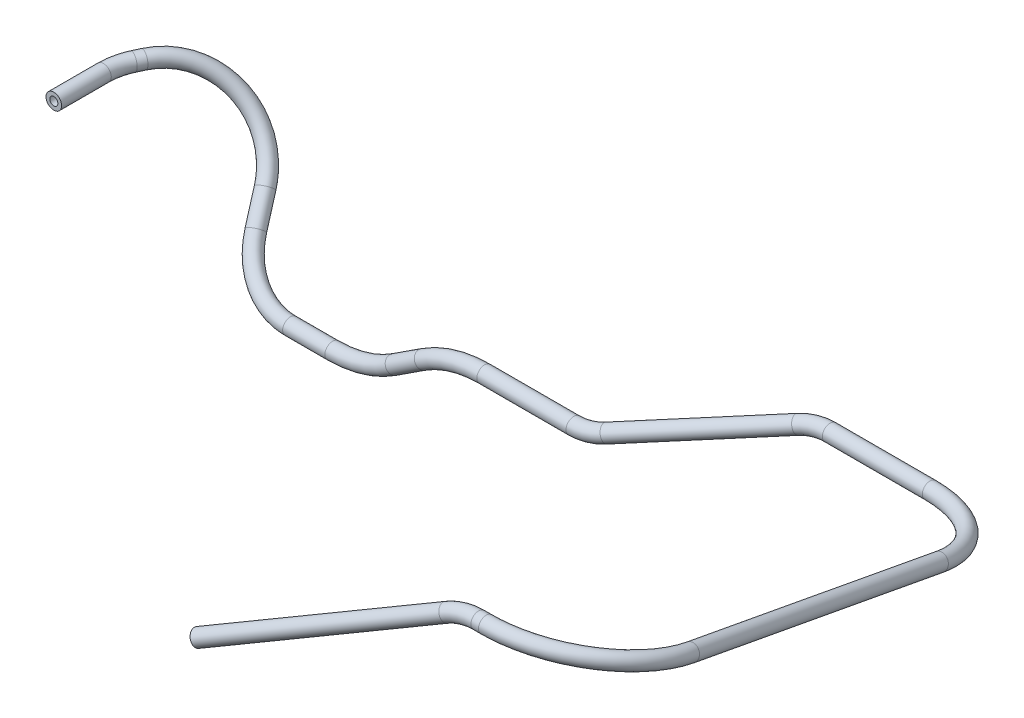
ISO-10303-21;
HEADER;
FILE_DESCRIPTION(('STEP AP214'),'2;1');
FILE_NAME('part.step','',(''),(''),'','','');
FILE_SCHEMA(('AUTOMOTIVE_DESIGN { 1 0 10303 214 1 1 1 1 }'));
ENDSEC;
DATA;
#1=APPLICATION_CONTEXT('core data for automotive mechanical design processes');
#2=APPLICATION_PROTOCOL_DEFINITION('international standard','automotive_design',2000,#1);
#3=PRODUCT_CONTEXT('',#1,'mechanical');
#4=PRODUCT('Part','Part','',(#3));
#5=PRODUCT_RELATED_PRODUCT_CATEGORY('part','',(#4));
#6=PRODUCT_DEFINITION_FORMATION('','',#4);
#7=PRODUCT_DEFINITION_CONTEXT('part definition',#1,'design');
#8=PRODUCT_DEFINITION('design','',#6,#7);
#9=PRODUCT_DEFINITION_SHAPE('','',#8);
#10=(LENGTH_UNIT() NAMED_UNIT(*) SI_UNIT(.MILLI.,.METRE.));
#11=(NAMED_UNIT(*) PLANE_ANGLE_UNIT() SI_UNIT($,.RADIAN.));
#12=(NAMED_UNIT(*) SI_UNIT($,.STERADIAN.) SOLID_ANGLE_UNIT());
#13=UNCERTAINTY_MEASURE_WITH_UNIT(LENGTH_MEASURE(1.E-05),#10,'distance_accuracy_value','');
#14=(GEOMETRIC_REPRESENTATION_CONTEXT(3) GLOBAL_UNCERTAINTY_ASSIGNED_CONTEXT((#13)) GLOBAL_UNIT_ASSIGNED_CONTEXT((#10,
#11,#12)) REPRESENTATION_CONTEXT('',''));
#15=CARTESIAN_POINT('',(0.,0.,0.));
#16=DIRECTION('',(0.,0.,1.));
#17=DIRECTION('',(1.,0.,0.));
#18=AXIS2_PLACEMENT_3D('',#15,#16,#17);
#19=CARTESIAN_POINT('',(19.688568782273,-17.0835573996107,-23.2734551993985));
#20=DIRECTION('',(0.348972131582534,-0.678855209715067,0.646044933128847));
#21=DIRECTION('',(0.,-0.68938439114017,-0.724395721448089));
#22=AXIS2_PLACEMENT_3D('',#19,#20,#21);
#23=CYLINDRICAL_SURFACE('',#22,0.825500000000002);
#24=CARTESIAN_POINT('',(19.688568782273,-17.0835573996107,-23.2734551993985));
#25=DIRECTION('',(0.348972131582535,-0.678855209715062,0.646044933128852));
#26=DIRECTION('',(0.610216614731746,-0.358598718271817,-0.706429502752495));
#27=AXIS2_PLACEMENT_3D('',#24,#25,#26);
#28=CIRCLE('',#27,0.825500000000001);
#29=CARTESIAN_POINT('',(20.192302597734,-17.379580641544,-23.8566127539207));
#30=VERTEX_POINT('',#29);
#31=EDGE_CURVE('E346',#30,#30,#28,.F.);
#32=ORIENTED_EDGE('',*,*,#31,.T.);
#33=EDGE_LOOP('',(#32));
#34=FACE_BOUND('',#33,.T.);
#35=CARTESIAN_POINT('',(21.9045418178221,-21.3942879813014,-19.1710698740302));
#36=DIRECTION('',(0.348972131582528,-0.678855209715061,0.646044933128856));
#37=DIRECTION('',(-0.937133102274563,-0.252793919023,0.240575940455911));
#38=AXIS2_PLACEMENT_3D('',#35,#36,#37);
#39=CIRCLE('',#38,0.825500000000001);
#40=CARTESIAN_POINT('',(21.1309384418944,-21.6029693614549,-18.9724744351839));
#41=VERTEX_POINT('',#40);
#42=EDGE_CURVE('E365',#41,#41,#39,.T.);
#43=ORIENTED_EDGE('',*,*,#42,.T.);
#44=EDGE_LOOP('',(#43));
#45=FACE_BOUND('',#44,.T.);
#46=ADVANCED_FACE('F15',(#34,#45),#23,.F.);
#47=CARTESIAN_POINT('',(35.4164393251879,-17.7494209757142,-22.6397739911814));
#48=DIRECTION('',(0.,0.689384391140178,0.724395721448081));
#49=DIRECTION('',(1.,0.,0.));
#50=AXIS2_PLACEMENT_3D('',#47,#48,#49);
#51=TOROIDAL_SURFACE('',#50,14.4183333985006,0.825500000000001);
#52=ORIENTED_EDGE('',*,*,#42,.F.);
#53=EDGE_LOOP('',(#52));
#54=FACE_BOUND('',#53,.T.);
#55=CARTESIAN_POINT('',(35.4164393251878,-28.194,-12.7));
#56=DIRECTION('',(1.,0.,0.));
#57=DIRECTION('',(0.,0.,-1.));
#58=AXIS2_PLACEMENT_3D('',#55,#56,#57);
#59=CIRCLE('',#58,0.825500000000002);
#60=CARTESIAN_POINT('',(35.4164393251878,-28.194,-13.5255));
#61=VERTEX_POINT('',#60);
#62=EDGE_CURVE('E341',#61,#61,#59,.T.);
#63=ORIENTED_EDGE('',*,*,#62,.T.);
#64=EDGE_LOOP('',(#63));
#65=FACE_BOUND('',#64,.T.);
#66=ADVANCED_FACE('F357',(#54,#65),#51,.F.);
#67=CARTESIAN_POINT('',(10.4785734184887,-11.6712292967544,-12.6113193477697));
#68=DIRECTION('',(-0.71123423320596,-0.640751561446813,-0.289107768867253));
#69=DIRECTION('',(0.702955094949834,-0.648298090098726,-0.292512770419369));
#70=AXIS2_PLACEMENT_3D('',#67,#68,#69);
#71=TOROIDAL_SURFACE('',#70,15.09299344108,0.825500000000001);
#72=CARTESIAN_POINT('',(1.67497659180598,-0.087763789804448,-16.6260996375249));
#73=DIRECTION('',(0.392324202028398,-0.0205566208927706,-0.919597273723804));
#74=DIRECTION('',(-0.919791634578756,0.,-0.392407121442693));
#75=AXIS2_PLACEMENT_3D('',#72,#73,#74);
#76=CIRCLE('',#75,0.8255);
#77=CARTESIAN_POINT('',(0.915688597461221,-0.087763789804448,-16.9500317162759));
#78=VERTEX_POINT('',#77);
#79=EDGE_CURVE('E336',#78,#78,#76,.F.);
#80=ORIENTED_EDGE('',*,*,#79,.T.);
#81=EDGE_LOOP('',(#80));
#82=FACE_BOUND('',#81,.T.);
#83=ORIENTED_EDGE('',*,*,#31,.F.);
#84=EDGE_LOOP('',(#83));
#85=FACE_BOUND('',#84,.T.);
#86=ADVANCED_FACE('F353',(#82,#85),#71,.F.);
#87=CARTESIAN_POINT('',(35.4164393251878,-28.194,-12.7));
#88=DIRECTION('',(1.,0.,0.));
#89=DIRECTION('',(0.,0.,-1.));
#90=AXIS2_PLACEMENT_3D('',#87,#88,#89);
#91=CYLINDRICAL_SURFACE('',#90,0.825500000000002);
#92=ORIENTED_EDGE('',*,*,#62,.F.);
#93=EDGE_LOOP('',(#92));
#94=FACE_BOUND('',#93,.T.);
#95=CARTESIAN_POINT('',(44.0021066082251,-28.194,-12.7));
#96=DIRECTION('',(1.,0.,0.));
#97=DIRECTION('',(0.,-1.,0.));
#98=AXIS2_PLACEMENT_3D('',#95,#96,#97);
#99=CIRCLE('',#98,0.825500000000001);
#100=CARTESIAN_POINT('',(44.0021066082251,-29.0195,-12.7));
#101=VERTEX_POINT('',#100);
#102=EDGE_CURVE('E330',#101,#101,#99,.T.);
#103=ORIENTED_EDGE('',*,*,#102,.T.);
#104=EDGE_LOOP('',(#103));
#105=FACE_BOUND('',#104,.T.);
#106=ADVANCED_FACE('F356',(#94,#105),#91,.F.);
#107=CARTESIAN_POINT('',(1.01971579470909,-0.0534300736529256,-15.0901861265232));
#108=DIRECTION('',(0.392324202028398,-0.0205566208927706,-0.919597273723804));
#109=DIRECTION('',(-0.919791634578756,0.,-0.392407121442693));
#110=AXIS2_PLACEMENT_3D('',#107,#108,#109);
#111=CYLINDRICAL_SURFACE('',#110,0.8255);
#112=CARTESIAN_POINT('',(1.01971579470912,-0.0534300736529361,-15.0901861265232));
#113=DIRECTION('',(0.392324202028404,-0.0205566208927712,-0.919597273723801));
#114=DIRECTION('',(-0.918337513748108,0.0481181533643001,-0.392862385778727));
#115=AXIS2_PLACEMENT_3D('',#112,#113,#114);
#116=CIRCLE('',#115,0.8255);
#117=CARTESIAN_POINT('',(0.261628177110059,-0.0137085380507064,-15.4144940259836));
#118=VERTEX_POINT('',#117);
#119=EDGE_CURVE('E326',#118,#118,#116,.F.);
#120=ORIENTED_EDGE('',*,*,#119,.T.);
#121=EDGE_LOOP('',(#120));
#122=FACE_BOUND('',#121,.T.);
#123=ORIENTED_EDGE('',*,*,#79,.F.);
#124=EDGE_LOOP('',(#123));
#125=FACE_BOUND('',#124,.T.);
#126=ADVANCED_FACE('F648',(#122,#125),#111,.F.);
#127=CARTESIAN_POINT('',(44.0021066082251,-5.334,-12.7));
#128=DIRECTION('',(0.,0.,1.));
#129=DIRECTION('',(1.,0.,0.));
#130=AXIS2_PLACEMENT_3D('',#127,#128,#129);
#131=TOROIDAL_SURFACE('',#130,22.86,0.825500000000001);
#132=ORIENTED_EDGE('',*,*,#102,.F.);
#133=EDGE_LOOP('',(#132));
#134=FACE_BOUND('',#133,.T.);
#135=CARTESIAN_POINT('',(56.493305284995,-24.4794839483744,-12.7));
#136=DIRECTION('',(0.83751023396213,0.546421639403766,0.));
#137=DIRECTION('',(-0.546421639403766,0.83751023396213,0.));
#138=AXIS2_PLACEMENT_3D('',#135,#136,#137);
#139=CIRCLE('',#138,0.825500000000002);
#140=CARTESIAN_POINT('',(56.0422342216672,-23.7881192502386,-12.7));
#141=VERTEX_POINT('',#140);
#142=EDGE_CURVE('E329',#141,#141,#139,.T.);
#143=ORIENTED_EDGE('',*,*,#142,.T.);
#144=EDGE_LOOP('',(#143));
#145=FACE_BOUND('',#144,.T.);
#146=ADVANCED_FACE('F317',(#134,#145),#131,.F.);
#147=CARTESIAN_POINT('',(12.6826022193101,-0.664530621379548,-10.1008338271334));
#148=DIRECTION('',(-0.0523252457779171,-0.998630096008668,0.));
#149=DIRECTION('',(0.998630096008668,-0.0523252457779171,0.));
#150=AXIS2_PLACEMENT_3D('',#147,#148,#149);
#151=TOROIDAL_SURFACE('',#150,12.7,0.8255);
#152=CARTESIAN_POINT('',(0.,0.,-10.1008338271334));
#153=DIRECTION('',(0.,0.,-1.));
#154=DIRECTION('',(-1.,0.,0.));
#155=AXIS2_PLACEMENT_3D('',#152,#153,#154);
#156=CIRCLE('',#155,0.8255);
#157=CARTESIAN_POINT('',(-0.8255,0.,-10.1008338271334));
#158=VERTEX_POINT('',#157);
#159=EDGE_CURVE('E702',#158,#158,#156,.F.);
#160=ORIENTED_EDGE('',*,*,#159,.T.);
#161=EDGE_LOOP('',(#160));
#162=FACE_BOUND('',#161,.T.);
#163=ORIENTED_EDGE('',*,*,#119,.F.);
#164=EDGE_LOOP('',(#163));
#165=FACE_BOUND('',#164,.T.);
#166=ADVANCED_FACE('F312',(#162,#165),#151,.F.);
#167=CARTESIAN_POINT('',(56.493305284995,-24.4794839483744,-12.7));
#168=DIRECTION('',(0.83751023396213,0.546421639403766,0.));
#169=DIRECTION('',(-0.546421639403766,0.83751023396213,0.));
#170=AXIS2_PLACEMENT_3D('',#167,#168,#169);
#171=CYLINDRICAL_SURFACE('',#170,0.825500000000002);
#172=ORIENTED_EDGE('',*,*,#142,.F.);
#173=EDGE_LOOP('',(#172));
#174=FACE_BOUND('',#173,.T.);
#175=CARTESIAN_POINT('',(62.4112423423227,-20.6184100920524,-12.7));
#176=DIRECTION('',(0.837510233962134,0.546421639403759,0.));
#177=DIRECTION('',(-0.546421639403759,0.837510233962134,0.));
#178=AXIS2_PLACEMENT_3D('',#175,#176,#177);
#179=CIRCLE('',#178,0.825500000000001);
#180=CARTESIAN_POINT('',(61.9601712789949,-19.9270453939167,-12.7));
#181=VERTEX_POINT('',#180);
#182=EDGE_CURVE('E296',#181,#181,#179,.T.);
#183=ORIENTED_EDGE('',*,*,#182,.T.);
#184=EDGE_LOOP('',(#183));
#185=FACE_BOUND('',#184,.T.);
#186=ADVANCED_FACE('F308',(#174,#185),#171,.F.);
#187=CARTESIAN_POINT('',(0.,0.,0.));
#188=DIRECTION('',(0.,0.,-1.));
#189=DIRECTION('',(-1.,0.,0.));
#190=AXIS2_PLACEMENT_3D('',#187,#188,#189);
#191=CYLINDRICAL_SURFACE('',#190,0.8255);
#192=CARTESIAN_POINT('',(0.,0.,0.));
#193=DIRECTION('',(0.,0.,-1.));
#194=DIRECTION('',(-1.,0.,0.));
#195=AXIS2_PLACEMENT_3D('',#192,#193,#194);
#196=CIRCLE('',#195,0.8255);
#197=CARTESIAN_POINT('',(-0.8255,0.,0.));
#198=VERTEX_POINT('',#197);
#199=EDGE_CURVE('E18',#198,#198,#196,.T.);
#200=ORIENTED_EDGE('',*,*,#199,.F.);
#201=EDGE_LOOP('',(#200));
#202=FACE_BOUND('',#201,.T.);
#203=ORIENTED_EDGE('',*,*,#159,.F.);
#204=EDGE_LOOP('',(#203));
#205=FACE_BOUND('',#204,.T.);
#206=ADVANCED_FACE('F304',(#202,#205),#191,.F.);
#207=CARTESIAN_POINT('',(74.9024410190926,-39.7638940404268,-12.7));
#208=DIRECTION('',(0.,0.,-1.));
#209=DIRECTION('',(1.,0.,0.));
#210=AXIS2_PLACEMENT_3D('',#207,#208,#209);
#211=TOROIDAL_SURFACE('',#210,22.86,0.825500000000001);
#212=ORIENTED_EDGE('',*,*,#182,.F.);
#213=EDGE_LOOP('',(#212));
#214=FACE_BOUND('',#213,.T.);
#215=CARTESIAN_POINT('',(74.9024410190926,-16.9038940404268,-12.7));
#216=DIRECTION('',(1.,0.,0.));
#217=DIRECTION('',(0.,0.,-1.));
#218=AXIS2_PLACEMENT_3D('',#215,#216,#217);
#219=CIRCLE('',#218,0.825500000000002);
#220=CARTESIAN_POINT('',(74.9024410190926,-16.9038940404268,-13.5255));
#221=VERTEX_POINT('',#220);
#222=EDGE_CURVE('E289',#221,#221,#219,.T.);
#223=ORIENTED_EDGE('',*,*,#222,.T.);
#224=EDGE_LOOP('',(#223));
#225=FACE_BOUND('',#224,.T.);
#226=ADVANCED_FACE('F299',(#214,#225),#211,.F.);
#227=CARTESIAN_POINT('',(0.,0.,0.));
#228=DIRECTION('',(0.,0.,1.));
#229=DIRECTION('',(1.,0.,0.));
#230=AXIS2_PLACEMENT_3D('',#227,#228,#229);
#231=PLANE('',#230);
#232=ORIENTED_EDGE('',*,*,#199,.T.);
#233=EDGE_LOOP('',(#232));
#234=FACE_BOUND('',#233,.T.);
#235=CARTESIAN_POINT('',(0.,0.,0.));
#236=DIRECTION('',(0.,0.,-1.));
#237=DIRECTION('',(-1.,0.,0.));
#238=AXIS2_PLACEMENT_3D('',#235,#236,#237);
#239=CIRCLE('',#238,1.5875);
#240=CARTESIAN_POINT('',(-1.5875,0.,0.));
#241=VERTEX_POINT('',#240);
#242=EDGE_CURVE('E286',#241,#241,#239,.T.);
#243=ORIENTED_EDGE('',*,*,#242,.F.);
#244=EDGE_LOOP('',(#243));
#245=FACE_BOUND('',#244,.T.);
#246=ADVANCED_FACE('F303',(#234,#245),#231,.T.);
#247=CARTESIAN_POINT('',(74.9024410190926,-16.9038940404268,-12.7));
#248=DIRECTION('',(1.,0.,0.));
#249=DIRECTION('',(0.,0.,-1.));
#250=AXIS2_PLACEMENT_3D('',#247,#248,#249);
#251=CYLINDRICAL_SURFACE('',#250,0.825500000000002);
#252=ORIENTED_EDGE('',*,*,#222,.F.);
#253=EDGE_LOOP('',(#252));
#254=FACE_BOUND('',#253,.T.);
#255=CARTESIAN_POINT('',(93.0384381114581,-16.9038940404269,-12.7));
#256=DIRECTION('',(1.,0.,0.));
#257=DIRECTION('',(0.,-0.779129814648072,0.626862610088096));
#258=AXIS2_PLACEMENT_3D('',#255,#256,#257);
#259=CIRCLE('',#258,0.825500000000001);
#260=CARTESIAN_POINT('',(93.0384381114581,-17.5470657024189,-12.1825249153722));
#261=VERTEX_POINT('',#260);
#262=EDGE_CURVE('E283',#261,#261,#259,.T.);
#263=ORIENTED_EDGE('',*,*,#262,.T.);
#264=EDGE_LOOP('',(#263));
#265=FACE_BOUND('',#264,.T.);
#266=ADVANCED_FACE('F381',(#254,#265),#251,.F.);
#267=CARTESIAN_POINT('',(0.,0.,0.));
#268=DIRECTION('',(0.,0.,-1.));
#269=DIRECTION('',(-1.,0.,0.));
#270=AXIS2_PLACEMENT_3D('',#267,#268,#269);
#271=CYLINDRICAL_SURFACE('',#270,1.5875);
#272=ORIENTED_EDGE('',*,*,#242,.T.);
#273=EDGE_LOOP('',(#272));
#274=FACE_BOUND('',#273,.T.);
#275=CARTESIAN_POINT('',(0.,0.,-10.1008338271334));
#276=DIRECTION('',(0.,0.,-1.));
#277=DIRECTION('',(-0.998630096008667,0.0523252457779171,0.));
#278=AXIS2_PLACEMENT_3D('',#275,#276,#277);
#279=CIRCLE('',#278,1.5875);
#280=CARTESIAN_POINT('',(-1.58532527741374,0.0830663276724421,-10.1008338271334));
#281=VERTEX_POINT('',#280);
#282=EDGE_CURVE('E261',#281,#281,#279,.T.);
#283=ORIENTED_EDGE('',*,*,#282,.F.);
#284=EDGE_LOOP('',(#283));
#285=FACE_BOUND('',#284,.T.);
#286=ADVANCED_FACE('F277',(#274,#285),#271,.T.);
#287=CARTESIAN_POINT('',(93.0384381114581,-7.00894539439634,-20.6611551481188));
#288=DIRECTION('',(0.,0.626862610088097,0.779129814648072));
#289=DIRECTION('',(1.,0.,0.));
#290=AXIS2_PLACEMENT_3D('',#287,#288,#289);
#291=TOROIDAL_SURFACE('',#290,12.7,0.825500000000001);
#292=ORIENTED_EDGE('',*,*,#262,.F.);
#293=EDGE_LOOP('',(#292));
#294=FACE_BOUND('',#293,.T.);
#295=CARTESIAN_POINT('',(98.7661993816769,-15.8403999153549,-13.5556529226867));
#296=DIRECTION('',(0.892521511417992,0.351391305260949,-0.282718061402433));
#297=DIRECTION('',(-0.366336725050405,0.930482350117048,0.));
#298=AXIS2_PLACEMENT_3D('',#295,#296,#297);
#299=CIRCLE('',#298,0.825500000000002);
#300=CARTESIAN_POINT('',(98.4637884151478,-15.0722867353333,-13.5556529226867));
#301=VERTEX_POINT('',#300);
#302=EDGE_CURVE('E256',#301,#301,#299,.T.);
#303=ORIENTED_EDGE('',*,*,#302,.T.);
#304=EDGE_LOOP('',(#303));
#305=FACE_BOUND('',#304,.T.);
#306=ADVANCED_FACE('F272',(#294,#305),#291,.F.);
#307=CARTESIAN_POINT('',(12.6826022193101,-0.664530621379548,-10.1008338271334));
#308=DIRECTION('',(-0.0523252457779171,-0.998630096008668,0.));
#309=DIRECTION('',(0.998630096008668,-0.0523252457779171,0.));
#310=AXIS2_PLACEMENT_3D('',#307,#308,#309);
#311=TOROIDAL_SURFACE('',#310,12.7,1.5875);
#312=ORIENTED_EDGE('',*,*,#282,.T.);
#313=EDGE_LOOP('',(#312));
#314=FACE_BOUND('',#313,.T.);
#315=CARTESIAN_POINT('',(1.01971579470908,-0.0534300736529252,-15.0901861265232));
#316=DIRECTION('',(0.392324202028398,-0.0205566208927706,-0.919597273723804));
#317=DIRECTION('',(-0.919791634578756,0.,-0.392407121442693));
#318=AXIS2_PLACEMENT_3D('',#315,#316,#317);
#319=CIRCLE('',#318,1.5875);
#320=CARTESIAN_POINT('',(-0.440453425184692,-0.0534300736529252,-15.7131324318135));
#321=VERTEX_POINT('',#320);
#322=EDGE_CURVE('E251',#321,#321,#319,.T.);
#323=ORIENTED_EDGE('',*,*,#322,.F.);
#324=EDGE_LOOP('',(#323));
#325=FACE_BOUND('',#324,.T.);
#326=ADVANCED_FACE('F268',(#314,#325),#311,.T.);
#327=CARTESIAN_POINT('',(98.7661993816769,-15.8403999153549,-13.5556529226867));
#328=DIRECTION('',(0.892521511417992,0.351391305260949,-0.282718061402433));
#329=DIRECTION('',(-0.366336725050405,0.930482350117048,0.));
#330=AXIS2_PLACEMENT_3D('',#327,#328,#329);
#331=CYLINDRICAL_SURFACE('',#330,0.825500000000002);
#332=ORIENTED_EDGE('',*,*,#302,.F.);
#333=EDGE_LOOP('',(#332));
#334=FACE_BOUND('',#333,.T.);
#335=CARTESIAN_POINT('',(128.344262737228,-4.19533124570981,-22.9248979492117));
#336=DIRECTION('',(0.892521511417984,0.351391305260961,-0.282718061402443));
#337=DIRECTION('',(-0.451004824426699,0.695390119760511,-0.55948836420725));
#338=AXIS2_PLACEMENT_3D('',#335,#336,#337);
#339=CIRCLE('',#338,0.825500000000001);
#340=CARTESIAN_POINT('',(127.971958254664,-3.62128670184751,-23.3867555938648));
#341=VERTEX_POINT('',#340);
#342=EDGE_CURVE('E248',#341,#341,#339,.T.);
#343=ORIENTED_EDGE('',*,*,#342,.T.);
#344=EDGE_LOOP('',(#343));
#345=FACE_BOUND('',#344,.T.);
#346=ADVANCED_FACE('F271',(#334,#345),#331,.F.);
#347=CARTESIAN_POINT('',(1.01971579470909,-0.0534300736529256,-15.0901861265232));
#348=DIRECTION('',(0.392324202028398,-0.0205566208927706,-0.919597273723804));
#349=DIRECTION('',(-0.919791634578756,0.,-0.392407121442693));
#350=AXIS2_PLACEMENT_3D('',#347,#348,#349);
#351=CYLINDRICAL_SURFACE('',#350,1.5875);
#352=ORIENTED_EDGE('',*,*,#322,.T.);
#353=EDGE_LOOP('',(#352));
#354=FACE_BOUND('',#353,.T.);
#355=CARTESIAN_POINT('',(1.67497659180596,-0.0877637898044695,-16.6260996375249));
#356=DIRECTION('',(0.392324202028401,-0.0205566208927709,-0.919597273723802));
#357=DIRECTION('',(-0.583290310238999,0.767473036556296,-0.266002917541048));
#358=AXIS2_PLACEMENT_3D('',#355,#356,#357);
#359=CIRCLE('',#358,1.5875);
#360=CARTESIAN_POINT('',(0.749003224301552,1.13059965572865,-17.0483792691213));
#361=VERTEX_POINT('',#360);
#362=EDGE_CURVE('E226',#361,#361,#359,.T.);
#363=ORIENTED_EDGE('',*,*,#362,.F.);
#364=EDGE_LOOP('',(#363));
#365=FACE_BOUND('',#364,.T.);
#366=ADVANCED_FACE('F242',(#354,#365),#351,.T.);
#367=CARTESIAN_POINT('',(134.072024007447,-13.0267857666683,-15.8193957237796));
#368=DIRECTION('',(0.,-0.626862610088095,-0.779129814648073));
#369=DIRECTION('',(1.,0.,0.));
#370=AXIS2_PLACEMENT_3D('',#367,#368,#369);
#371=TOROIDAL_SURFACE('',#370,12.7,0.825500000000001);
#372=ORIENTED_EDGE('',*,*,#342,.F.);
#373=EDGE_LOOP('',(#372));
#374=FACE_BOUND('',#373,.T.);
#375=CARTESIAN_POINT('',(134.072024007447,-3.13183712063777,-23.7805508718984));
#376=DIRECTION('',(1.,0.,0.));
#377=DIRECTION('',(0.,1.,0.));
#378=AXIS2_PLACEMENT_3D('',#375,#376,#377);
#379=CIRCLE('',#378,0.825500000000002);
#380=CARTESIAN_POINT('',(134.072024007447,-2.30633712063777,-23.7805508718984));
#381=VERTEX_POINT('',#380);
#382=EDGE_CURVE('E221',#381,#381,#379,.T.);
#383=ORIENTED_EDGE('',*,*,#382,.T.);
#384=EDGE_LOOP('',(#383));
#385=FACE_BOUND('',#384,.T.);
#386=ADVANCED_FACE('F237',(#374,#385),#371,.F.);
#387=CARTESIAN_POINT('',(10.4785734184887,-11.6712292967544,-12.6113193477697));
#388=DIRECTION('',(-0.71123423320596,-0.640751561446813,-0.289107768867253));
#389=DIRECTION('',(0.702955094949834,-0.648298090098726,-0.292512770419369));
#390=AXIS2_PLACEMENT_3D('',#387,#388,#389);
#391=TOROIDAL_SURFACE('',#390,15.09299344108,1.5875);
#392=ORIENTED_EDGE('',*,*,#362,.T.);
#393=EDGE_LOOP('',(#392));
#394=FACE_BOUND('',#393,.T.);
#395=CARTESIAN_POINT('',(19.688568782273,-17.0835573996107,-23.2734551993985));
#396=DIRECTION('',(0.348972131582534,-0.678855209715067,0.646044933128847));
#397=DIRECTION('',(0.,-0.68938439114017,-0.724395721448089));
#398=AXIS2_PLACEMENT_3D('',#395,#396,#397);
#399=CIRCLE('',#398,1.5875);
#400=CARTESIAN_POINT('',(19.688568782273,-18.1779551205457,-24.4234334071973));
#401=VERTEX_POINT('',#400);
#402=EDGE_CURVE('E216',#401,#401,#399,.T.);
#403=ORIENTED_EDGE('',*,*,#402,.F.);
#404=EDGE_LOOP('',(#403));
#405=FACE_BOUND('',#404,.T.);
#406=ADVANCED_FACE('F233',(#394,#405),#391,.T.);
#407=CARTESIAN_POINT('',(134.072024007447,-3.13183712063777,-23.7805508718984));
#408=DIRECTION('',(1.,0.,0.));
#409=DIRECTION('',(0.,1.,0.));
#410=AXIS2_PLACEMENT_3D('',#407,#408,#409);
#411=CYLINDRICAL_SURFACE('',#410,0.825500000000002);
#412=ORIENTED_EDGE('',*,*,#382,.F.);
#413=EDGE_LOOP('',(#412));
#414=FACE_BOUND('',#413,.T.);
#415=CARTESIAN_POINT('',(154.397864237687,-3.1318371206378,-23.7805508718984));
#416=DIRECTION('',(1.,0.,0.));
#417=DIRECTION('',(0.,-0.249318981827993,-0.968421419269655));
#418=AXIS2_PLACEMENT_3D('',#415,#416,#417);
#419=CIRCLE('',#418,0.825500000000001);
#420=CARTESIAN_POINT('',(154.397864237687,-3.33764994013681,-24.5799827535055));
#421=VERTEX_POINT('',#420);
#422=EDGE_CURVE('E213',#421,#421,#419,.T.);
#423=ORIENTED_EDGE('',*,*,#422,.T.);
#424=EDGE_LOOP('',(#423));
#425=FACE_BOUND('',#424,.T.);
#426=ADVANCED_FACE('F236',(#414,#425),#411,.F.);
#427=CARTESIAN_POINT('',(19.688568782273,-17.0835573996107,-23.2734551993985));
#428=DIRECTION('',(0.348972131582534,-0.678855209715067,0.646044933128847));
#429=DIRECTION('',(0.,-0.68938439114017,-0.724395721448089));
#430=AXIS2_PLACEMENT_3D('',#427,#428,#429);
#431=CYLINDRICAL_SURFACE('',#430,1.5875);
#432=ORIENTED_EDGE('',*,*,#402,.T.);
#433=EDGE_LOOP('',(#432));
#434=FACE_BOUND('',#433,.T.);
#435=CARTESIAN_POINT('',(21.9045418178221,-21.3942879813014,-19.1710698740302));
#436=DIRECTION('',(0.348972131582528,-0.67885520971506,0.646044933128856));
#437=DIRECTION('',(-0.937133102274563,-0.252793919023,0.240575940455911));
#438=AXIS2_PLACEMENT_3D('',#435,#436,#437);
#439=CIRCLE('',#438,1.5875);
#440=CARTESIAN_POINT('',(20.4168430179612,-21.7955983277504,-18.7891555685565));
#441=VERTEX_POINT('',#440);
#442=EDGE_CURVE('E191',#441,#441,#439,.T.);
#443=ORIENTED_EDGE('',*,*,#442,.F.);
#444=EDGE_LOOP('',(#443));
#445=FACE_BOUND('',#444,.T.);
#446=ADVANCED_FACE('F207',(#434,#445),#431,.T.);
#447=CARTESIAN_POINT('',(154.397864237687,1.30105437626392,-6.56201803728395));
#448=DIRECTION('',(0.,-0.968421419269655,0.249318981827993));
#449=DIRECTION('',(1.,0.,0.));
#450=AXIS2_PLACEMENT_3D('',#447,#448,#449);
#451=TOROIDAL_SURFACE('',#450,17.78,0.825500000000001);
#452=ORIENTED_EDGE('',*,*,#422,.F.);
#453=EDGE_LOOP('',(#452));
#454=FACE_BOUND('',#453,.T.);
#455=CARTESIAN_POINT('',(172.112887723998,0.922422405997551,-8.03272559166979));
#456=DIRECTION('',(0.0854142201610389,0.2484078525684,0.964882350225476));
#457=DIRECTION('',(0.,-0.968421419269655,0.249318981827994));
#458=AXIS2_PLACEMENT_3D('',#455,#456,#457);
#459=CIRCLE('',#458,0.825500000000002);
#460=CARTESIAN_POINT('',(172.112887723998,0.122990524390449,-7.82691277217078));
#461=VERTEX_POINT('',#460);
#462=EDGE_CURVE('E186',#461,#461,#459,.T.);
#463=ORIENTED_EDGE('',*,*,#462,.T.);
#464=EDGE_LOOP('',(#463));
#465=FACE_BOUND('',#464,.T.);
#466=ADVANCED_FACE('F202',(#454,#465),#451,.F.);
#467=CARTESIAN_POINT('',(35.4164393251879,-17.7494209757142,-22.6397739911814));
#468=DIRECTION('',(0.,0.689384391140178,0.724395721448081));
#469=DIRECTION('',(1.,0.,0.));
#470=AXIS2_PLACEMENT_3D('',#467,#468,#469);
#471=TOROIDAL_SURFACE('',#470,14.4183333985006,1.5875);
#472=ORIENTED_EDGE('',*,*,#442,.T.);
#473=EDGE_LOOP('',(#472));
#474=FACE_BOUND('',#473,.T.);
#475=CARTESIAN_POINT('',(35.4164393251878,-28.194,-12.7));
#476=DIRECTION('',(1.,0.,0.));
#477=DIRECTION('',(0.,0.,-1.));
#478=AXIS2_PLACEMENT_3D('',#475,#476,#477);
#479=CIRCLE('',#478,1.5875);
#480=CARTESIAN_POINT('',(35.4164393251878,-28.194,-14.2875));
#481=VERTEX_POINT('',#480);
#482=EDGE_CURVE('E181',#481,#481,#479,.T.);
#483=ORIENTED_EDGE('',*,*,#482,.F.);
#484=EDGE_LOOP('',(#483));
#485=FACE_BOUND('',#484,.T.);
#486=ADVANCED_FACE('F198',(#474,#485),#471,.T.);
#487=CARTESIAN_POINT('',(172.112887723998,0.922422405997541,-8.03272559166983));
#488=DIRECTION('',(0.0854142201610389,0.2484078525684,0.964882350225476));
#489=DIRECTION('',(0.,-0.968421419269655,0.249318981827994));
#490=AXIS2_PLACEMENT_3D('',#487,#488,#489);
#491=CYLINDRICAL_SURFACE('',#490,0.825500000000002);
#492=ORIENTED_EDGE('',*,*,#462,.F.);
#493=EDGE_LOOP('',(#492));
#494=FACE_BOUND('',#493,.T.);
#495=CARTESIAN_POINT('',(177.028090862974,15.2171739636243,47.4919018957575));
#496=DIRECTION('',(0.0854142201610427,0.248407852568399,0.964882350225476));
#497=DIRECTION('',(0.996345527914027,-0.0212953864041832,-0.0827169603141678));
#498=AXIS2_PLACEMENT_3D('',#495,#496,#497);
#499=CIRCLE('',#498,0.825500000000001);
#500=CARTESIAN_POINT('',(177.850574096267,15.1995946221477,47.4236190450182));
#501=VERTEX_POINT('',#500);
#502=EDGE_CURVE('E178',#501,#501,#499,.T.);
#503=ORIENTED_EDGE('',*,*,#502,.T.);
#504=EDGE_LOOP('',(#503));
#505=FACE_BOUND('',#504,.T.);
#506=ADVANCED_FACE('F201',(#494,#505),#491,.F.);
#507=CARTESIAN_POINT('',(35.4164393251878,-28.194,-12.7));
#508=DIRECTION('',(1.,0.,0.));
#509=DIRECTION('',(0.,0.,-1.));
#510=AXIS2_PLACEMENT_3D('',#507,#508,#509);
#511=CYLINDRICAL_SURFACE('',#510,1.5875);
#512=ORIENTED_EDGE('',*,*,#482,.T.);
#513=EDGE_LOOP('',(#512));
#514=FACE_BOUND('',#513,.T.);
#515=CARTESIAN_POINT('',(44.0021066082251,-28.194,-12.7));
#516=DIRECTION('',(1.,0.,0.));
#517=DIRECTION('',(0.,-1.,0.));
#518=AXIS2_PLACEMENT_3D('',#515,#516,#517);
#519=CIRCLE('',#518,1.5875);
#520=CARTESIAN_POINT('',(44.0021066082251,-29.7815,-12.7));
#521=VERTEX_POINT('',#520);
#522=EDGE_CURVE('E155',#521,#521,#519,.T.);
#523=ORIENTED_EDGE('',*,*,#522,.F.);
#524=EDGE_LOOP('',(#523));
#525=FACE_BOUND('',#524,.T.);
#526=ADVANCED_FACE('F172',(#514,#525),#511,.T.);
#527=CARTESIAN_POINT('',(156.782349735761,15.6498962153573,49.1727105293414));
#528=DIRECTION('',(0.,-0.968421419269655,0.249318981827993));
#529=DIRECTION('',(1.,0.,0.));
#530=AXIS2_PLACEMENT_3D('',#527,#528,#529);
#531=TOROIDAL_SURFACE('',#530,20.32,0.825500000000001);
#532=ORIENTED_EDGE('',*,*,#502,.F.);
#533=EDGE_LOOP('',(#532));
#534=FACE_BOUND('',#533,.T.);
#535=CARTESIAN_POINT('',(156.782349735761,20.7160579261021,68.8510337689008));
#536=DIRECTION('',(-1.,0.,0.));
#537=DIRECTION('',(0.,0.,1.));
#538=AXIS2_PLACEMENT_3D('',#535,#536,#537);
#539=CIRCLE('',#538,0.825500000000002);
#540=CARTESIAN_POINT('',(156.782349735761,20.7160579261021,69.6765337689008));
#541=VERTEX_POINT('',#540);
#542=EDGE_CURVE('E150',#541,#541,#539,.T.);
#543=ORIENTED_EDGE('',*,*,#542,.T.);
#544=EDGE_LOOP('',(#543));
#545=FACE_BOUND('',#544,.T.);
#546=ADVANCED_FACE('F167',(#534,#545),#531,.F.);
#547=CARTESIAN_POINT('',(44.0021066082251,-5.334,-12.7));
#548=DIRECTION('',(0.,0.,1.));
#549=DIRECTION('',(1.,0.,0.));
#550=AXIS2_PLACEMENT_3D('',#547,#548,#549);
#551=TOROIDAL_SURFACE('',#550,22.86,1.5875);
#552=ORIENTED_EDGE('',*,*,#522,.T.);
#553=EDGE_LOOP('',(#552));
#554=FACE_BOUND('',#553,.T.);
#555=CARTESIAN_POINT('',(56.493305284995,-24.4794839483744,-12.7));
#556=DIRECTION('',(0.83751023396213,0.546421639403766,0.));
#557=DIRECTION('',(-0.546421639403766,0.83751023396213,0.));
#558=AXIS2_PLACEMENT_3D('',#555,#556,#557);
#559=CIRCLE('',#558,1.5875);
#560=CARTESIAN_POINT('',(55.6258609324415,-23.1499364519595,-12.7));
#561=VERTEX_POINT('',#560);
#562=EDGE_CURVE('E145',#561,#561,#559,.T.);
#563=ORIENTED_EDGE('',*,*,#562,.F.);
#564=EDGE_LOOP('',(#563));
#565=FACE_BOUND('',#564,.T.);
#566=ADVANCED_FACE('F162',(#554,#565),#551,.T.);
#567=CARTESIAN_POINT('',(156.782349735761,20.7160579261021,68.8510337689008));
#568=DIRECTION('',(-1.,0.,0.));
#569=DIRECTION('',(0.,0.,1.));
#570=AXIS2_PLACEMENT_3D('',#567,#568,#569);
#571=CYLINDRICAL_SURFACE('',#570,0.825500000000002);
#572=ORIENTED_EDGE('',*,*,#542,.F.);
#573=EDGE_LOOP('',(#572));
#574=FACE_BOUND('',#573,.T.);
#575=CARTESIAN_POINT('',(155.239054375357,20.716057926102,68.8510337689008));
#576=DIRECTION('',(-1.,0.,0.));
#577=DIRECTION('',(0.,0.950134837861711,-0.311839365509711));
#578=AXIS2_PLACEMENT_3D('',#575,#576,#577);
#579=CIRCLE('',#578,0.825500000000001);
#580=CARTESIAN_POINT('',(155.239054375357,21.5003942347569,68.5936103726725));
#581=VERTEX_POINT('',#580);
#582=EDGE_CURVE('E139',#581,#581,#579,.T.);
#583=ORIENTED_EDGE('',*,*,#582,.T.);
#584=EDGE_LOOP('',(#583));
#585=FACE_BOUND('',#584,.T.);
#586=ADVANCED_FACE('F166',(#574,#585),#571,.F.);
#587=CARTESIAN_POINT('',(56.493305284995,-24.4794839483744,-12.7));
#588=DIRECTION('',(0.83751023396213,0.546421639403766,0.));
#589=DIRECTION('',(-0.546421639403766,0.83751023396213,0.));
#590=AXIS2_PLACEMENT_3D('',#587,#588,#589);
#591=CYLINDRICAL_SURFACE('',#590,1.5875);
#592=ORIENTED_EDGE('',*,*,#562,.T.);
#593=EDGE_LOOP('',(#592));
#594=FACE_BOUND('',#593,.T.);
#595=CARTESIAN_POINT('',(62.4112423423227,-20.6184100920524,-12.7));
#596=DIRECTION('',(0.837510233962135,0.546421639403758,0.));
#597=DIRECTION('',(-0.546421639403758,0.837510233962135,0.));
#598=AXIS2_PLACEMENT_3D('',#595,#596,#597);
#599=CIRCLE('',#598,1.5875);
#600=CARTESIAN_POINT('',(61.5437979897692,-19.2888625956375,-12.7));
#601=VERTEX_POINT('',#600);
#602=EDGE_CURVE('E135',#601,#601,#599,.T.);
#603=ORIENTED_EDGE('',*,*,#602,.F.);
#604=EDGE_LOOP('',(#603));
#605=FACE_BOUND('',#604,.T.);
#606=ADVANCED_FACE('F509',(#594,#605),#591,.T.);
#607=CARTESIAN_POINT('',(155.239054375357,8.64934548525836,72.8113937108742));
#608=DIRECTION('',(0.,0.311839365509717,0.95013483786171));
#609=DIRECTION('',(1.,0.,0.));
#610=AXIS2_PLACEMENT_3D('',#607,#608,#609);
#611=TOROIDAL_SURFACE('',#610,12.7,0.825500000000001);
#612=ORIENTED_EDGE('',*,*,#582,.F.);
#613=EDGE_LOOP('',(#612));
#614=FACE_BOUND('',#613,.T.);
#615=CARTESIAN_POINT('',(149.163980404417,19.2459466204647,69.3335322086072));
#616=DIRECTION('',(-0.878168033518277,-0.454499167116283,0.149169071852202));
#617=DIRECTION('',(0.459641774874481,-0.888104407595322,0.));
#618=AXIS2_PLACEMENT_3D('',#615,#616,#617);
#619=CIRCLE('',#618,0.825500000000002);
#620=CARTESIAN_POINT('',(149.543414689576,18.5128164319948,69.3335322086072));
#621=VERTEX_POINT('',#620);
#622=EDGE_CURVE('E138',#621,#621,#619,.T.);
#623=ORIENTED_EDGE('',*,*,#622,.T.);
#624=EDGE_LOOP('',(#623));
#625=FACE_BOUND('',#624,.T.);
#626=ADVANCED_FACE('F126',(#614,#625),#611,.F.);
#627=CARTESIAN_POINT('',(74.9024410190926,-39.7638940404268,-12.7));
#628=DIRECTION('',(0.,0.,-1.));
#629=DIRECTION('',(1.,0.,0.));
#630=AXIS2_PLACEMENT_3D('',#627,#628,#629);
#631=TOROIDAL_SURFACE('',#630,22.86,1.5875);
#632=ORIENTED_EDGE('',*,*,#602,.T.);
#633=EDGE_LOOP('',(#632));
#634=FACE_BOUND('',#633,.T.);
#635=CARTESIAN_POINT('',(74.9024410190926,-16.9038940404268,-12.7));
#636=DIRECTION('',(1.,0.,0.));
#637=DIRECTION('',(0.,0.,-1.));
#638=AXIS2_PLACEMENT_3D('',#635,#636,#637);
#639=CIRCLE('',#638,1.5875);
#640=CARTESIAN_POINT('',(74.9024410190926,-16.9038940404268,-14.2875));
#641=VERTEX_POINT('',#640);
#642=EDGE_CURVE('E374',#641,#641,#639,.T.);
#643=ORIENTED_EDGE('',*,*,#642,.F.);
#644=EDGE_LOOP('',(#643));
#645=FACE_BOUND('',#644,.T.);
#646=ADVANCED_FACE('F121',(#634,#645),#631,.T.);
#647=CARTESIAN_POINT('',(149.163980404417,19.2459466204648,69.3335322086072));
#648=DIRECTION('',(-0.878168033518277,-0.454499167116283,0.149169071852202));
#649=DIRECTION('',(0.459641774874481,-0.888104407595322,0.));
#650=AXIS2_PLACEMENT_3D('',#647,#648,#649);
#651=CYLINDRICAL_SURFACE('',#650,0.825500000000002);
#652=ORIENTED_EDGE('',*,*,#622,.F.);
#653=EDGE_LOOP('',(#652));
#654=FACE_BOUND('',#653,.T.);
#655=CARTESIAN_POINT('',(105.926377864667,-3.13183712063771,76.6780412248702));
#656=DIRECTION('',(-0.878168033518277,-0.454499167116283,0.149169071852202));
#657=DIRECTION('',(0.459641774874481,-0.888104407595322,0.));
#658=AXIS2_PLACEMENT_3D('',#655,#656,#657);
#659=CIRCLE('',#658,0.825500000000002);
#660=CARTESIAN_POINT('',(106.305812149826,-3.86496730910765,76.6780412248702));
#661=VERTEX_POINT('',#660);
#662=EDGE_CURVE('E372',#661,#661,#659,.T.);
#663=ORIENTED_EDGE('',*,*,#662,.T.);
#664=EDGE_LOOP('',(#663));
#665=FACE_BOUND('',#664,.T.);
#666=ADVANCED_FACE('F117',(#654,#665),#651,.F.);
#667=CARTESIAN_POINT('',(74.9024410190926,-16.9038940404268,-12.7));
#668=DIRECTION('',(1.,0.,0.));
#669=DIRECTION('',(0.,0.,-1.));
#670=AXIS2_PLACEMENT_3D('',#667,#668,#669);
#671=CYLINDRICAL_SURFACE('',#670,1.5875);
#672=ORIENTED_EDGE('',*,*,#642,.T.);
#673=EDGE_LOOP('',(#672));
#674=FACE_BOUND('',#673,.T.);
#675=CARTESIAN_POINT('',(93.0384381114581,-16.9038940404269,-12.7));
#676=DIRECTION('',(1.,0.,0.));
#677=DIRECTION('',(0.,-0.779129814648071,0.626862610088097));
#678=AXIS2_PLACEMENT_3D('',#675,#676,#677);
#679=CIRCLE('',#678,1.5875);
#680=CARTESIAN_POINT('',(93.0384381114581,-18.1407626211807,-11.7048556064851));
#681=VERTEX_POINT('',#680);
#682=EDGE_CURVE('E102',#681,#681,#679,.T.);
#683=ORIENTED_EDGE('',*,*,#682,.F.);
#684=EDGE_LOOP('',(#683));
#685=FACE_BOUND('',#684,.T.);
#686=ADVANCED_FACE('F113',(#674,#685),#671,.T.);
#687=CARTESIAN_POINT('',(105.926377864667,-3.13183712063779,76.6780412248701));
#688=DIRECTION('',(0.878168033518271,0.454499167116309,-0.149169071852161));
#689=DIRECTION('',(-0.459641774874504,0.888104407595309,0.));
#690=AXIS2_PLACEMENT_3D('',#687,#688,#689);
#691=PLANE('',#690);
#692=ORIENTED_EDGE('',*,*,#662,.F.);
#693=EDGE_LOOP('',(#692));
#694=FACE_BOUND('',#693,.T.);
#695=CARTESIAN_POINT('',(105.926377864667,-3.13183712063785,76.6780412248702));
#696=DIRECTION('',(-0.878168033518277,-0.454499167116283,0.149169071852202));
#697=DIRECTION('',(0.459641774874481,-0.888104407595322,0.));
#698=AXIS2_PLACEMENT_3D('',#695,#696,#697);
#699=CIRCLE('',#698,1.5875);
#700=CARTESIAN_POINT('',(106.65605918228,-4.54170286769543,76.6780412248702));
#701=VERTEX_POINT('',#700);
#702=EDGE_CURVE('E97',#701,#701,#699,.F.);
#703=ORIENTED_EDGE('',*,*,#702,.F.);
#704=EDGE_LOOP('',(#703));
#705=FACE_BOUND('',#704,.T.);
#706=ADVANCED_FACE('F109',(#694,#705),#691,.F.);
#707=CARTESIAN_POINT('',(93.0384381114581,-7.00894539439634,-20.6611551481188));
#708=DIRECTION('',(0.,0.626862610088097,0.779129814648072));
#709=DIRECTION('',(1.,0.,0.));
#710=AXIS2_PLACEMENT_3D('',#707,#708,#709);
#711=TOROIDAL_SURFACE('',#710,12.7,1.5875);
#712=ORIENTED_EDGE('',*,*,#682,.T.);
#713=EDGE_LOOP('',(#712));
#714=FACE_BOUND('',#713,.T.);
#715=CARTESIAN_POINT('',(98.766199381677,-15.8403999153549,-13.5556529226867));
#716=DIRECTION('',(0.892521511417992,0.351391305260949,-0.282718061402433));
#717=DIRECTION('',(-0.366336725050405,0.930482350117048,0.));
#718=AXIS2_PLACEMENT_3D('',#715,#716,#717);
#719=CIRCLE('',#718,1.5875);
#720=CARTESIAN_POINT('',(98.1846398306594,-14.3632591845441,-13.5556529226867));
#721=VERTEX_POINT('',#720);
#722=EDGE_CURVE('E92',#721,#721,#719,.T.);
#723=ORIENTED_EDGE('',*,*,#722,.F.);
#724=EDGE_LOOP('',(#723));
#725=FACE_BOUND('',#724,.T.);
#726=ADVANCED_FACE('F105',(#714,#725),#711,.T.);
#727=CARTESIAN_POINT('',(149.163980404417,19.2459466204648,69.3335322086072));
#728=DIRECTION('',(-0.878168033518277,-0.454499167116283,0.149169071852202));
#729=DIRECTION('',(0.459641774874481,-0.888104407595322,0.));
#730=AXIS2_PLACEMENT_3D('',#727,#728,#729);
#731=CYLINDRICAL_SURFACE('',#730,1.5875);
#732=CARTESIAN_POINT('',(149.163980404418,19.2459466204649,69.333532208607));
#733=DIRECTION('',(-0.878168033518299,-0.454499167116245,0.149169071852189));
#734=DIRECTION('',(-0.478352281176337,0.83437804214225,-0.273847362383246));
#735=AXIS2_PLACEMENT_3D('',#732,#733,#734);
#736=CIRCLE('',#735,1.5875);
#737=CARTESIAN_POINT('',(148.40459615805,20.5705217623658,68.8987995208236));
#738=VERTEX_POINT('',#737);
#739=EDGE_CURVE('E89',#738,#738,#736,.F.);
#740=ORIENTED_EDGE('',*,*,#739,.F.);
#741=EDGE_LOOP('',(#740));
#742=FACE_BOUND('',#741,.T.);
#743=ORIENTED_EDGE('',*,*,#702,.T.);
#744=EDGE_LOOP('',(#743));
#745=FACE_BOUND('',#744,.T.);
#746=ADVANCED_FACE('F108',(#742,#745),#731,.T.);
#747=CARTESIAN_POINT('',(98.7661993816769,-15.8403999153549,-13.5556529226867));
#748=DIRECTION('',(0.892521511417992,0.351391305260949,-0.282718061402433));
#749=DIRECTION('',(-0.366336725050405,0.930482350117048,0.));
#750=AXIS2_PLACEMENT_3D('',#747,#748,#749);
#751=CYLINDRICAL_SURFACE('',#750,1.5875);
#752=ORIENTED_EDGE('',*,*,#722,.T.);
#753=EDGE_LOOP('',(#752));
#754=FACE_BOUND('',#753,.T.);
#755=CARTESIAN_POINT('',(128.344262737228,-4.19533124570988,-22.9248979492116));
#756=DIRECTION('',(0.892521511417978,0.351391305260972,-0.282718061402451));
#757=DIRECTION('',(-0.451004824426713,0.695390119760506,-0.559488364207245));
#758=AXIS2_PLACEMENT_3D('',#755,#756,#757);
#759=CIRCLE('',#758,1.5875);
#760=CARTESIAN_POINT('',(127.62829257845,-3.09139943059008,-23.8130857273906));
#761=VERTEX_POINT('',#760);
#762=EDGE_CURVE('E67',#761,#761,#759,.T.);
#763=ORIENTED_EDGE('',*,*,#762,.F.);
#764=EDGE_LOOP('',(#763));
#765=FACE_BOUND('',#764,.T.);
#766=ADVANCED_FACE('F83',(#754,#765),#751,.T.);
#767=CARTESIAN_POINT('',(155.239054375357,8.64934548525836,72.8113937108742));
#768=DIRECTION('',(0.,0.311839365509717,0.95013483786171));
#769=DIRECTION('',(1.,0.,0.));
#770=AXIS2_PLACEMENT_3D('',#767,#768,#769);
#771=TOROIDAL_SURFACE('',#770,12.7,1.5875);
#772=CARTESIAN_POINT('',(155.239054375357,20.7160579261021,68.8510337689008));
#773=DIRECTION('',(-1.,0.,0.));
#774=DIRECTION('',(0.,0.,1.));
#775=AXIS2_PLACEMENT_3D('',#772,#773,#774);
#776=CIRCLE('',#775,1.5875);
#777=CARTESIAN_POINT('',(155.239054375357,20.7160579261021,70.4385337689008));
#778=VERTEX_POINT('',#777);
#779=EDGE_CURVE('E62',#778,#778,#776,.F.);
#780=ORIENTED_EDGE('',*,*,#779,.F.);
#781=EDGE_LOOP('',(#780));
#782=FACE_BOUND('',#781,.T.);
#783=ORIENTED_EDGE('',*,*,#739,.T.);
#784=EDGE_LOOP('',(#783));
#785=FACE_BOUND('',#784,.T.);
#786=ADVANCED_FACE('F78',(#782,#785),#771,.T.);
#787=CARTESIAN_POINT('',(134.072024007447,-13.0267857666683,-15.8193957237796));
#788=DIRECTION('',(0.,-0.626862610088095,-0.779129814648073));
#789=DIRECTION('',(1.,0.,0.));
#790=AXIS2_PLACEMENT_3D('',#787,#788,#789);
#791=TOROIDAL_SURFACE('',#790,12.7,1.5875);
#792=ORIENTED_EDGE('',*,*,#762,.T.);
#793=EDGE_LOOP('',(#792));
#794=FACE_BOUND('',#793,.T.);
#795=CARTESIAN_POINT('',(134.072024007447,-3.13183712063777,-23.7805508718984));
#796=DIRECTION('',(1.,0.,0.));
#797=DIRECTION('',(0.,1.,0.));
#798=AXIS2_PLACEMENT_3D('',#795,#796,#797);
#799=CIRCLE('',#798,1.5875);
#800=CARTESIAN_POINT('',(134.072024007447,-1.54433712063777,-23.7805508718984));
#801=VERTEX_POINT('',#800);
#802=EDGE_CURVE('E57',#801,#801,#799,.T.);
#803=ORIENTED_EDGE('',*,*,#802,.F.);
#804=EDGE_LOOP('',(#803));
#805=FACE_BOUND('',#804,.T.);
#806=ADVANCED_FACE('F74',(#794,#805),#791,.T.);
#807=CARTESIAN_POINT('',(156.782349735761,20.7160579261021,68.8510337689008));
#808=DIRECTION('',(-1.,0.,0.));
#809=DIRECTION('',(0.,0.,1.));
#810=AXIS2_PLACEMENT_3D('',#807,#808,#809);
#811=CYLINDRICAL_SURFACE('',#810,1.5875);
#812=CARTESIAN_POINT('',(156.782349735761,20.7160579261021,68.8510337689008));
#813=DIRECTION('',(-1.,0.,0.));
#814=DIRECTION('',(0.,0.249318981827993,0.968421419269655));
#815=AXIS2_PLACEMENT_3D('',#812,#813,#814);
#816=CIRCLE('',#815,1.5875);
#817=CARTESIAN_POINT('',(156.782349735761,21.1118518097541,70.3884027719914));
#818=VERTEX_POINT('',#817);
#819=EDGE_CURVE('E54',#818,#818,#816,.F.);
#820=ORIENTED_EDGE('',*,*,#819,.F.);
#821=EDGE_LOOP('',(#820));
#822=FACE_BOUND('',#821,.T.);
#823=ORIENTED_EDGE('',*,*,#779,.T.);
#824=EDGE_LOOP('',(#823));
#825=FACE_BOUND('',#824,.T.);
#826=ADVANCED_FACE('F77',(#822,#825),#811,.T.);
#827=CARTESIAN_POINT('',(134.072024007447,-3.13183712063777,-23.7805508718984));
#828=DIRECTION('',(1.,0.,0.));
#829=DIRECTION('',(0.,1.,0.));
#830=AXIS2_PLACEMENT_3D('',#827,#828,#829);
#831=CYLINDRICAL_SURFACE('',#830,1.5875);
#832=ORIENTED_EDGE('',*,*,#802,.T.);
#833=EDGE_LOOP('',(#832));
#834=FACE_BOUND('',#833,.T.);
#835=CARTESIAN_POINT('',(154.397864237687,-3.1318371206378,-23.7805508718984));
#836=DIRECTION('',(1.,0.,0.));
#837=DIRECTION('',(0.,-0.249318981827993,-0.968421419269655));
#838=AXIS2_PLACEMENT_3D('',#835,#836,#837);
#839=CIRCLE('',#838,1.5875);
#840=CARTESIAN_POINT('',(154.397864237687,-3.52763100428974,-25.317919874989));
#841=VERTEX_POINT('',#840);
#842=EDGE_CURVE('E27',#841,#841,#839,.T.);
#843=ORIENTED_EDGE('',*,*,#842,.F.);
#844=EDGE_LOOP('',(#843));
#845=FACE_BOUND('',#844,.T.);
#846=ADVANCED_FACE('F48',(#834,#845),#831,.T.);
#847=CARTESIAN_POINT('',(156.782349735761,15.6498962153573,49.1727105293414));
#848=DIRECTION('',(0.,-0.968421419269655,0.249318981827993));
#849=DIRECTION('',(1.,0.,0.));
#850=AXIS2_PLACEMENT_3D('',#847,#848,#849);
#851=TOROIDAL_SURFACE('',#850,20.32,1.5875);
#852=CARTESIAN_POINT('',(177.028090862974,15.2171739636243,47.4919018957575));
#853=DIRECTION('',(0.0854142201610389,0.2484078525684,0.964882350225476));
#854=DIRECTION('',(0.,-0.968421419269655,0.249318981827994));
#855=AXIS2_PLACEMENT_3D('',#852,#853,#854);
#856=CIRCLE('',#855,1.5875);
#857=CARTESIAN_POINT('',(177.028090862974,13.6798049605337,47.8876957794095));
#858=VERTEX_POINT('',#857);
#859=EDGE_CURVE('E22',#858,#858,#856,.F.);
#860=ORIENTED_EDGE('',*,*,#859,.F.);
#861=EDGE_LOOP('',(#860));
#862=FACE_BOUND('',#861,.T.);
#863=ORIENTED_EDGE('',*,*,#819,.T.);
#864=EDGE_LOOP('',(#863));
#865=FACE_BOUND('',#864,.T.);
#866=ADVANCED_FACE('F43',(#862,#865),#851,.T.);
#867=CARTESIAN_POINT('',(154.397864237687,1.30105437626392,-6.56201803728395));
#868=DIRECTION('',(0.,-0.968421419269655,0.249318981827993));
#869=DIRECTION('',(1.,0.,0.));
#870=AXIS2_PLACEMENT_3D('',#867,#868,#869);
#871=TOROIDAL_SURFACE('',#870,17.78,1.5875);
#872=ORIENTED_EDGE('',*,*,#842,.T.);
#873=EDGE_LOOP('',(#872));
#874=FACE_BOUND('',#873,.T.);
#875=CARTESIAN_POINT('',(172.112887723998,0.922422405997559,-8.03272559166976));
#876=DIRECTION('',(0.0854142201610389,0.2484078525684,0.964882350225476));
#877=DIRECTION('',(0.,-0.968421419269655,0.249318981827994));
#878=AXIS2_PLACEMENT_3D('',#875,#876,#877);
#879=CIRCLE('',#878,1.5875);
#880=CARTESIAN_POINT('',(172.112887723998,-0.614946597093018,-7.63693170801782));
#881=VERTEX_POINT('',#880);
#882=EDGE_CURVE('E10',#881,#881,#879,.T.);
#883=ORIENTED_EDGE('',*,*,#882,.F.);
#884=EDGE_LOOP('',(#883));
#885=FACE_BOUND('',#884,.T.);
#886=ADVANCED_FACE('F38',(#874,#885),#871,.T.);
#887=CARTESIAN_POINT('',(172.112887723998,0.922422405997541,-8.03272559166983));
#888=DIRECTION('',(0.0854142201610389,0.2484078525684,0.964882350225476));
#889=DIRECTION('',(0.,-0.968421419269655,0.249318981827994));
#890=AXIS2_PLACEMENT_3D('',#887,#888,#889);
#891=CYLINDRICAL_SURFACE('',#890,1.5875);
#892=ORIENTED_EDGE('',*,*,#882,.T.);
#893=EDGE_LOOP('',(#892));
#894=FACE_BOUND('',#893,.T.);
#895=ORIENTED_EDGE('',*,*,#859,.T.);
#896=EDGE_LOOP('',(#895));
#897=FACE_BOUND('',#896,.T.);
#898=ADVANCED_FACE('F42',(#894,#897),#891,.T.);
#899=CLOSED_SHELL('',(#46,#66,#86,#106,#126,#146,#166,#186,#206,#226,#246,#266,#286,#306,#326,
#346,#366,#386,#406,#426,#446,#466,#486,#506,#526,#546,#566,#586,#606,#626,#646,#666,#686,#706,
#726,#746,#766,#786,#806,#826,#846,#866,#886,#898));
#900=MANIFOLD_SOLID_BREP('B1',#899);
#901=ADVANCED_BREP_SHAPE_REPRESENTATION('',(#18,#900),#14);
#902=SHAPE_DEFINITION_REPRESENTATION(#9,#901);
ENDSEC;
END-ISO-10303-21;
